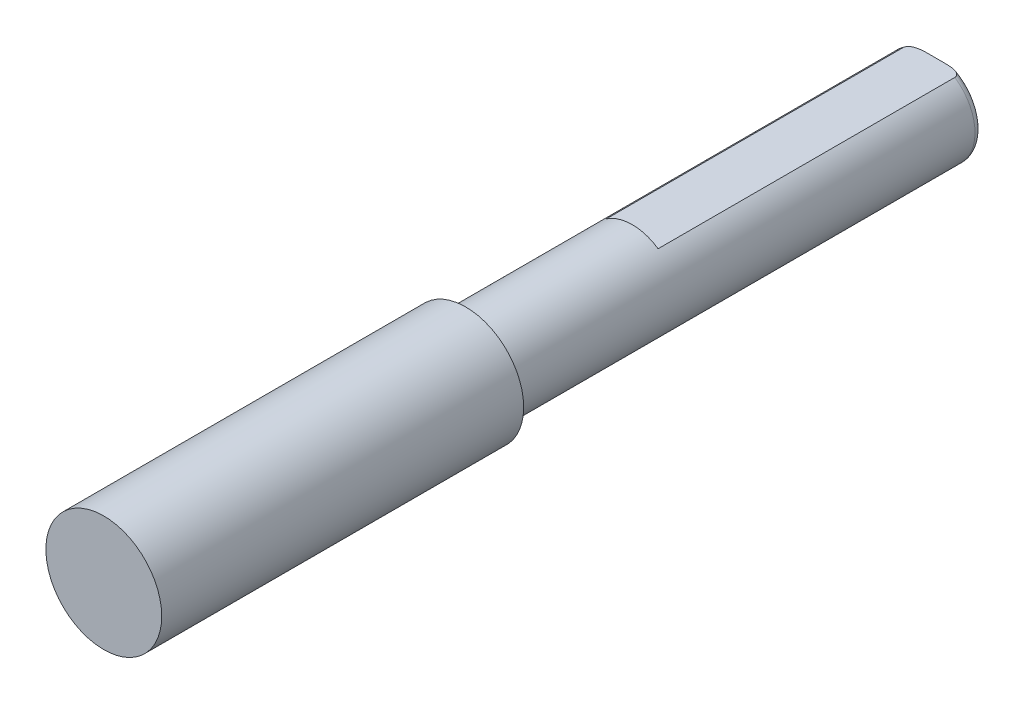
ISO-10303-21;
HEADER;
FILE_DESCRIPTION(('STEP AP214'),'2;1');
FILE_NAME('part.step','',(''),(''),'','','');
FILE_SCHEMA(('AUTOMOTIVE_DESIGN { 1 0 10303 214 1 1 1 1 }'));
ENDSEC;
DATA;
#1=APPLICATION_CONTEXT('core data for automotive mechanical design processes');
#2=APPLICATION_PROTOCOL_DEFINITION('international standard','automotive_design',2000,#1);
#3=PRODUCT_CONTEXT('',#1,'mechanical');
#4=PRODUCT('Part','Part','',(#3));
#5=PRODUCT_RELATED_PRODUCT_CATEGORY('part','',(#4));
#6=PRODUCT_DEFINITION_FORMATION('','',#4);
#7=PRODUCT_DEFINITION_CONTEXT('part definition',#1,'design');
#8=PRODUCT_DEFINITION('design','',#6,#7);
#9=PRODUCT_DEFINITION_SHAPE('','',#8);
#10=(LENGTH_UNIT() NAMED_UNIT(*) SI_UNIT(.MILLI.,.METRE.));
#11=(NAMED_UNIT(*) PLANE_ANGLE_UNIT() SI_UNIT($,.RADIAN.));
#12=(NAMED_UNIT(*) SI_UNIT($,.STERADIAN.) SOLID_ANGLE_UNIT());
#13=UNCERTAINTY_MEASURE_WITH_UNIT(LENGTH_MEASURE(1.E-05),#10,'distance_accuracy_value','');
#14=(GEOMETRIC_REPRESENTATION_CONTEXT(3) GLOBAL_UNCERTAINTY_ASSIGNED_CONTEXT((#13)) GLOBAL_UNIT_ASSIGNED_CONTEXT((#10,
#11,#12)) REPRESENTATION_CONTEXT('',''));
#15=CARTESIAN_POINT('',(0.,0.,0.));
#16=DIRECTION('',(0.,0.,1.));
#17=DIRECTION('',(1.,0.,0.));
#18=AXIS2_PLACEMENT_3D('',#15,#16,#17);
#19=CARTESIAN_POINT('',(0.,0.,32.5));
#20=DIRECTION('',(0.,0.,-1.));
#21=DIRECTION('',(-1.,0.,0.));
#22=AXIS2_PLACEMENT_3D('',#19,#20,#21);
#23=CYLINDRICAL_SURFACE('',#22,3.175);
#24=CARTESIAN_POINT('',(0.,0.,32.5));
#25=DIRECTION('',(0.,0.,1.));
#26=DIRECTION('',(1.,0.,0.));
#27=AXIS2_PLACEMENT_3D('',#24,#25,#26);
#28=CIRCLE('',#27,3.175);
#29=CARTESIAN_POINT('',(3.175,0.,32.5));
#30=VERTEX_POINT('',#29);
#31=EDGE_CURVE('E90',#30,#30,#28,.T.);
#32=ORIENTED_EDGE('',*,*,#31,.F.);
#33=EDGE_LOOP('',(#32));
#34=FACE_BOUND('',#33,.T.);
#35=DIRECTION('',(0.,0.,-1.));
#36=VECTOR('',#35,1.);
#37=CARTESIAN_POINT('',(-1.78605710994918,2.625,21.));
#38=LINE('',#37,#36);
#39=CARTESIAN_POINT('',(-1.78605710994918,2.625,21.));
#40=VERTEX_POINT('',#39);
#41=CARTESIAN_POINT('',(-1.78605710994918,2.625,0.500000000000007));
#42=VERTEX_POINT('',#41);
#43=EDGE_CURVE('E77',#40,#42,#38,.T.);
#44=ORIENTED_EDGE('',*,*,#43,.T.);
#45=CARTESIAN_POINT('',(0.,0.,0.5));
#46=DIRECTION('',(0.,0.,1.));
#47=DIRECTION('',(1.,0.,0.));
#48=AXIS2_PLACEMENT_3D('',#45,#46,#47);
#49=CIRCLE('',#48,3.175);
#50=CARTESIAN_POINT('',(1.78605710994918,2.625,0.500000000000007));
#51=VERTEX_POINT('',#50);
#52=EDGE_CURVE('E81',#42,#51,#49,.T.);
#53=ORIENTED_EDGE('',*,*,#52,.T.);
#54=DIRECTION('',(0.,0.,-1.));
#55=VECTOR('',#54,1.);
#56=CARTESIAN_POINT('',(1.78605710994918,2.625,21.));
#57=LINE('',#56,#55);
#58=CARTESIAN_POINT('',(1.78605710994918,2.625,21.));
#59=VERTEX_POINT('',#58);
#60=EDGE_CURVE('E76',#59,#51,#57,.T.);
#61=ORIENTED_EDGE('',*,*,#60,.F.);
#62=CARTESIAN_POINT('',(0.,0.,21.));
#63=DIRECTION('',(0.,0.,-1.));
#64=DIRECTION('',(-1.,0.,0.));
#65=AXIS2_PLACEMENT_3D('',#62,#63,#64);
#66=CIRCLE('',#65,3.175);
#67=EDGE_CURVE('E66',#40,#59,#66,.T.);
#68=ORIENTED_EDGE('',*,*,#67,.F.);
#69=EDGE_LOOP('',(#44,#53,#61,#68));
#70=FACE_BOUND('',#69,.T.);
#71=ADVANCED_FACE('F33',(#34,#70),#23,.T.);
#72=CARTESIAN_POINT('',(0.,0.,0.));
#73=DIRECTION('',(0.,0.,1.));
#74=DIRECTION('',(1.,0.,0.));
#75=AXIS2_PLACEMENT_3D('',#72,#73,#74);
#76=PLANE('',#75);
#77=DIRECTION('',(-1.,0.,0.));
#78=VECTOR('',#77,1.);
#79=CARTESIAN_POINT('',(1.78605710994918,2.625,0.));
#80=LINE('',#79,#78);
#81=CARTESIAN_POINT('',(0.514781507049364,2.625,0.));
#82=VERTEX_POINT('',#81);
#83=CARTESIAN_POINT('',(-0.514781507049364,2.625,0.));
#84=VERTEX_POINT('',#83);
#85=EDGE_CURVE('E73',#82,#84,#80,.T.);
#86=ORIENTED_EDGE('',*,*,#85,.F.);
#87=CARTESIAN_POINT('',(0.,0.,0.));
#88=DIRECTION('',(0.,0.,1.));
#89=DIRECTION('',(1.,0.,0.));
#90=AXIS2_PLACEMENT_3D('',#87,#88,#89);
#91=CIRCLE('',#90,2.675);
#92=EDGE_CURVE('E11',#82,#84,#91,.F.);
#93=ORIENTED_EDGE('',*,*,#92,.T.);
#94=EDGE_LOOP('',(#86,#93));
#95=FACE_BOUND('',#94,.T.);
#96=ADVANCED_FACE('F117',(#95),#76,.F.);
#97=CARTESIAN_POINT('',(0.,0.,32.5));
#98=DIRECTION('',(0.,0.,1.));
#99=DIRECTION('',(1.,0.,0.));
#100=AXIS2_PLACEMENT_3D('',#97,#98,#99);
#101=PLANE('',#100);
#102=CARTESIAN_POINT('',(0.,0.,32.5));
#103=DIRECTION('',(0.,0.,1.));
#104=DIRECTION('',(1.,0.,0.));
#105=AXIS2_PLACEMENT_3D('',#102,#103,#104);
#106=CIRCLE('',#105,4.);
#107=CARTESIAN_POINT('',(4.,0.,32.5));
#108=VERTEX_POINT('',#107);
#109=EDGE_CURVE('E83',#108,#108,#106,.T.);
#110=ORIENTED_EDGE('',*,*,#109,.F.);
#111=EDGE_LOOP('',(#110));
#112=FACE_BOUND('',#111,.T.);
#113=ORIENTED_EDGE('',*,*,#31,.T.);
#114=EDGE_LOOP('',(#113));
#115=FACE_BOUND('',#114,.T.);
#116=ADVANCED_FACE('F114',(#112,#115),#101,.F.);
#117=CARTESIAN_POINT('',(0.,0.,57.5));
#118=DIRECTION('',(0.,0.,-1.));
#119=DIRECTION('',(-1.,0.,0.));
#120=AXIS2_PLACEMENT_3D('',#117,#118,#119);
#121=CYLINDRICAL_SURFACE('',#120,4.);
#122=CARTESIAN_POINT('',(0.,0.,57.5));
#123=DIRECTION('',(0.,0.,1.));
#124=DIRECTION('',(1.,0.,0.));
#125=AXIS2_PLACEMENT_3D('',#122,#123,#124);
#126=CIRCLE('',#125,4.);
#127=CARTESIAN_POINT('',(4.,0.,57.5));
#128=VERTEX_POINT('',#127);
#129=EDGE_CURVE('E87',#128,#128,#126,.T.);
#130=ORIENTED_EDGE('',*,*,#129,.F.);
#131=EDGE_LOOP('',(#130));
#132=FACE_BOUND('',#131,.T.);
#133=ORIENTED_EDGE('',*,*,#109,.T.);
#134=EDGE_LOOP('',(#133));
#135=FACE_BOUND('',#134,.T.);
#136=ADVANCED_FACE('F112',(#132,#135),#121,.T.);
#137=CARTESIAN_POINT('',(0.,0.,57.5));
#138=DIRECTION('',(0.,0.,1.));
#139=DIRECTION('',(1.,0.,0.));
#140=AXIS2_PLACEMENT_3D('',#137,#138,#139);
#141=PLANE('',#140);
#142=ORIENTED_EDGE('',*,*,#129,.T.);
#143=EDGE_LOOP('',(#142));
#144=FACE_BOUND('',#143,.T.);
#145=ADVANCED_FACE('F108',(#144),#141,.T.);
#146=CARTESIAN_POINT('',(1.78605710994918,2.625,21.));
#147=DIRECTION('',(0.,-1.,0.));
#148=DIRECTION('',(0.,0.,-1.));
#149=AXIS2_PLACEMENT_3D('',#146,#147,#148);
#150=PLANE('',#149);
#151=ORIENTED_EDGE('',*,*,#60,.T.);
#152=CARTESIAN_POINT('',(1.78605710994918,2.625,0.5));
#153=CARTESIAN_POINT('',(1.7861183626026,2.625,0.480515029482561));
#154=CARTESIAN_POINT('',(1.78403706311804,2.625,0.461106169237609));
#155=CARTESIAN_POINT('',(1.77614566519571,2.625,0.423291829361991));
#156=CARTESIAN_POINT('',(1.77038040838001,2.625,0.404877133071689));
#157=CARTESIAN_POINT('',(1.75568721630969,2.625,0.369486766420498));
#158=CARTESIAN_POINT('',(1.74677356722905,2.625,0.352505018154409));
#159=CARTESIAN_POINT('',(1.72641804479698,2.625,0.320088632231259));
#160=CARTESIAN_POINT('',(1.71496821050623,2.625,0.304659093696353));
#161=CARTESIAN_POINT('',(1.68383170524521,2.625,0.26803343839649));
#162=CARTESIAN_POINT('',(1.66291485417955,2.625,0.247887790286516));
#163=CARTESIAN_POINT('',(1.61825721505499,2.625,0.211090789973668));
#164=CARTESIAN_POINT('',(1.59451232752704,2.625,0.194444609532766));
#165=CARTESIAN_POINT('',(1.52776741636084,2.625,0.153457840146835));
#166=CARTESIAN_POINT('',(1.48301267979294,2.625,0.131986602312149));
#167=CARTESIAN_POINT('',(1.41389871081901,2.625,0.104695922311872));
#168=CARTESIAN_POINT('',(1.39041958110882,2.625,0.0963921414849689));
#169=CARTESIAN_POINT('',(1.34299986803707,2.625,0.0812423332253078));
#170=CARTESIAN_POINT('',(1.31905952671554,2.625,0.074395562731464));
#171=CARTESIAN_POINT('',(1.23008070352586,2.625,0.0514093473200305));
#172=CARTESIAN_POINT('',(1.16404779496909,2.625,0.0391500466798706));
#173=CARTESIAN_POINT('',(1.03103589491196,2.625,0.0205768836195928));
#174=CARTESIAN_POINT('',(0.964054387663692,2.625,0.0142841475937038));
#175=CARTESIAN_POINT('',(0.833124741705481,2.625,0.00573297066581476));
#176=CARTESIAN_POINT('',(0.769187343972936,2.625,0.00329337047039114));
#177=CARTESIAN_POINT('',(0.67349457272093,2.625,0.0011481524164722));
#178=CARTESIAN_POINT('',(0.641749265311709,2.625,0.000684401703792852));
#179=CARTESIAN_POINT('',(0.578263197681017,2.625,0.000111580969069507));
#180=CARTESIAN_POINT('',(0.546522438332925,2.625,2.42149440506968E-06));
#181=CARTESIAN_POINT('',(0.514781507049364,2.625,0.));
#182=B_SPLINE_CURVE_WITH_KNOTS('',3,(#152,#153,#154,#155,#156,#157,#158,#159,#160,#161,#162,
#163,#164,#165,#166,#167,#168,#169,#170,#171,#172,#173,#174,#175,#176,#177,#178,#179,#180,#181),
.UNSPECIFIED.,.F.,.F.,(4,2,2,2,2,2,2,2,2,2,2,2,2,2,4),(0.,0.0582234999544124,0.115751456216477,
0.173021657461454,0.230474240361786,0.317101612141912,0.403856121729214,0.551884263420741,
0.62657755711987,0.701232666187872,0.90221485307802,1.10390604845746,1.29579765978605,
1.39104324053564,1.48626479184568),.UNSPECIFIED.);
#183=EDGE_CURVE('E42',#51,#82,#182,.T.);
#184=ORIENTED_EDGE('',*,*,#183,.T.);
#185=ORIENTED_EDGE('',*,*,#85,.T.);
#186=CARTESIAN_POINT('',(-0.514781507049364,2.625,0.));
#187=CARTESIAN_POINT('',(-0.545138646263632,2.625,1.99675866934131E-06));
#188=CARTESIAN_POINT('',(-0.575495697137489,2.625,0.00010207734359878));
#189=CARTESIAN_POINT('',(-0.63621318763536,2.625,0.000620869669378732));
#190=CARTESIAN_POINT('',(-0.666573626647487,2.625,0.00103964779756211));
#191=CARTESIAN_POINT('',(-0.757972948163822,2.625,0.00296465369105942));
#192=CARTESIAN_POINT('',(-0.819003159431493,2.625,0.00514219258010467));
#193=CARTESIAN_POINT('',(-0.941825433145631,2.625,0.0125778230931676));
#194=CARTESIAN_POINT('',(-1.00361494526,2.625,0.0178823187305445));
#195=CARTESIAN_POINT('',(-1.12651560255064,2.625,0.0332527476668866));
#196=CARTESIAN_POINT('',(-1.18762806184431,2.625,0.0433066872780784));
#197=CARTESIAN_POINT('',(-1.28243856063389,2.625,0.0645844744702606));
#198=CARTESIAN_POINT('',(-1.31665689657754,2.625,0.0734587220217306));
#199=CARTESIAN_POINT('',(-1.38423460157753,2.625,0.0940301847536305));
#200=CARTESIAN_POINT('',(-1.41759448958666,2.625,0.105725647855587));
#201=CARTESIAN_POINT('',(-1.48318231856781,2.625,0.132705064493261));
#202=CARTESIAN_POINT('',(-1.51539860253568,2.625,0.148017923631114));
#203=CARTESIAN_POINT('',(-1.57740901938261,2.625,0.182992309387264));
#204=CARTESIAN_POINT('',(-1.60720754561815,2.625,0.202645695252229));
#205=CARTESIAN_POINT('',(-1.65201841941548,2.625,0.238603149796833));
#206=CARTESIAN_POINT('',(-1.66831627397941,2.625,0.253297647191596));
#207=CARTESIAN_POINT('',(-1.69872512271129,2.625,0.28482495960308));
#208=CARTESIAN_POINT('',(-1.71283757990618,2.625,0.301656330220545));
#209=CARTESIAN_POINT('',(-1.73617877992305,2.625,0.334788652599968));
#210=CARTESIAN_POINT('',(-1.74582188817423,2.625,0.350794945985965));
#211=CARTESIAN_POINT('',(-1.76232487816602,2.625,0.38416491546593));
#212=CARTESIAN_POINT('',(-1.76919194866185,2.625,0.401524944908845));
#213=CARTESIAN_POINT('',(-1.77820439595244,2.625,0.432417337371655));
#214=CARTESIAN_POINT('',(-1.78112252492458,2.625,0.445725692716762));
#215=CARTESIAN_POINT('',(-1.78506131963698,2.625,0.472682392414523));
#216=CARTESIAN_POINT('',(-1.78607295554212,2.625,0.486332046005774));
#217=CARTESIAN_POINT('',(-1.78605710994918,2.625,0.500000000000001));
#218=B_SPLINE_CURVE_WITH_KNOTS('',3,(#186,#187,#188,#189,#190,#191,#192,#193,#194,#195,#196,
#197,#198,#199,#200,#201,#202,#203,#204,#205,#206,#207,#208,#209,#210,#211,#212,#213,#214,#215,
#216,#217),.UNSPECIFIED.,.F.,.F.,(4,2,2,2,2,2,2,2,2,2,2,2,2,2,2,4),(0.,0.091070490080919,
0.182159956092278,0.365318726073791,0.551266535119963,0.736747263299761,0.842706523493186,
0.948600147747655,1.05537040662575,1.16194209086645,1.22761113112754,1.2932360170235,
1.34908253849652,1.40478350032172,1.44552659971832,1.4864621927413),.UNSPECIFIED.);
#219=EDGE_CURVE('E96',#84,#42,#218,.T.);
#220=ORIENTED_EDGE('',*,*,#219,.T.);
#221=ORIENTED_EDGE('',*,*,#43,.F.);
#222=DIRECTION('',(-1.,0.,0.));
#223=VECTOR('',#222,1.);
#224=CARTESIAN_POINT('',(1.78605710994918,2.625,21.));
#225=LINE('',#224,#223);
#226=EDGE_CURVE('E69',#59,#40,#225,.T.);
#227=ORIENTED_EDGE('',*,*,#226,.F.);
#228=EDGE_LOOP('',(#151,#184,#185,#220,#221,#227));
#229=FACE_BOUND('',#228,.T.);
#230=ADVANCED_FACE('F75',(#229),#150,.F.);
#231=CARTESIAN_POINT('',(0.,0.,21.));
#232=DIRECTION('',(0.,0.,-1.));
#233=DIRECTION('',(-1.,0.,0.));
#234=AXIS2_PLACEMENT_3D('',#231,#232,#233);
#235=PLANE('',#234);
#236=ORIENTED_EDGE('',*,*,#67,.T.);
#237=ORIENTED_EDGE('',*,*,#226,.T.);
#238=EDGE_LOOP('',(#236,#237));
#239=FACE_BOUND('',#238,.T.);
#240=ADVANCED_FACE('F68',(#239),#235,.T.);
#241=CARTESIAN_POINT('',(0.,0.,0.5));
#242=DIRECTION('',(0.,0.,1.));
#243=DIRECTION('',(1.,0.,0.));
#244=AXIS2_PLACEMENT_3D('',#241,#242,#243);
#245=TOROIDAL_SURFACE('',#244,2.675,0.5);
#246=ORIENTED_EDGE('',*,*,#219,.F.);
#247=ORIENTED_EDGE('',*,*,#92,.F.);
#248=ORIENTED_EDGE('',*,*,#183,.F.);
#249=ORIENTED_EDGE('',*,*,#52,.F.);
#250=EDGE_LOOP('',(#246,#247,#248,#249));
#251=FACE_BOUND('',#250,.T.);
#252=ADVANCED_FACE('F35',(#251),#245,.T.);
#253=CLOSED_SHELL('',(#71,#96,#116,#136,#145,#230,#240,#252));
#254=MANIFOLD_SOLID_BREP('B2',#253);
#255=ADVANCED_BREP_SHAPE_REPRESENTATION('',(#18,#254),#14);
#256=SHAPE_DEFINITION_REPRESENTATION(#9,#255);
ENDSEC;
END-ISO-10303-21;
